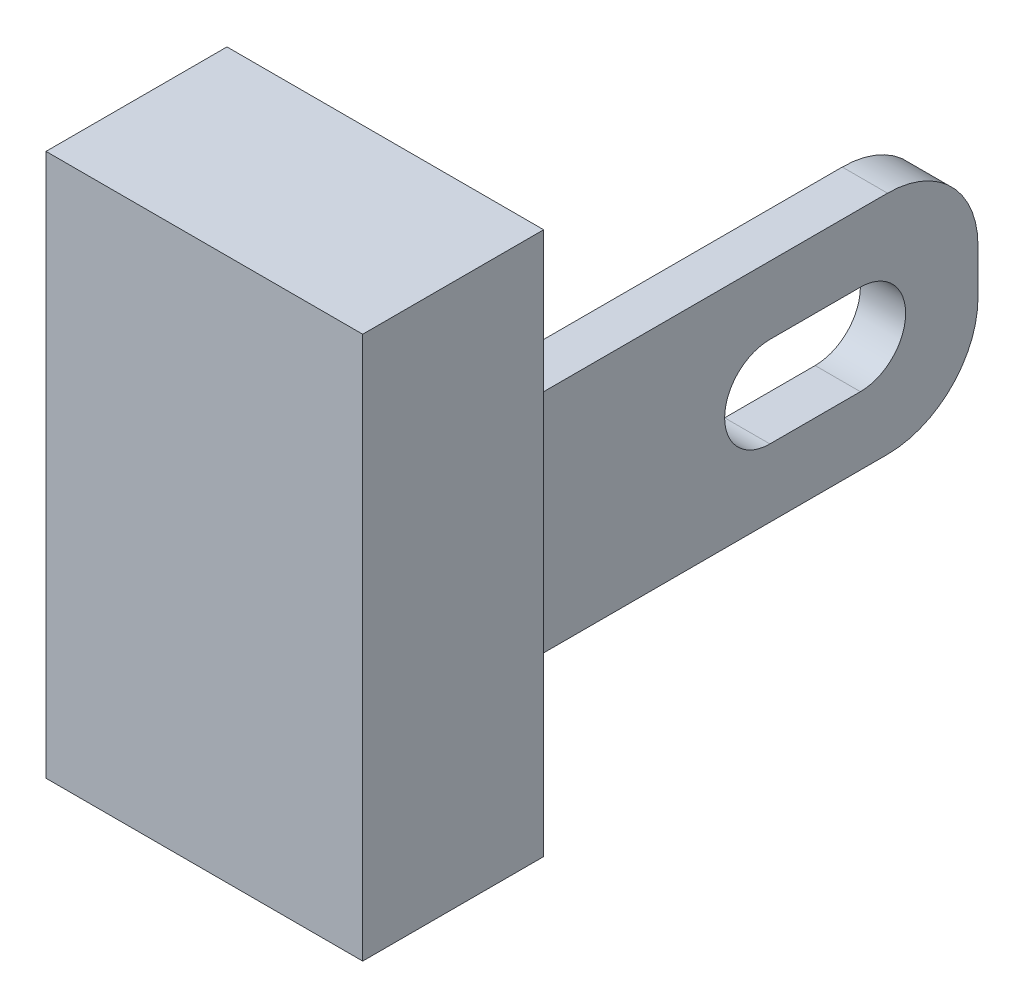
from build123d import *

# Parameters (mm, degrees)
SKETCH1_W           = 3.5
SKETCH1_H           = 6
BOSS_EXTRUDE1_DEPTH = 2
SKETCH2_W           = 0.5
SKETCH2_H           = 2.5
BOSS_EXTRUDE2_DEPTH = 5
FILLET1_R           = 1
CUT_EXTRUDE1_DEPTH  = 5


with BuildPart() as part:
    # Sketch1 → Boss-Extrude1 (new body)
    with BuildSketch(Plane.XY):
        Rectangle(SKETCH1_W, SKETCH1_H)
    extrude(amount=BOSS_EXTRUDE1_DEPTH)

    # Sketch2 → Boss-Extrude2 (add)
    with BuildSketch(Plane(origin=(0, 0, 0), x_dir=(-1, 0, 0), z_dir=(0, 0, -1))):
        with Locations((-1.3, 0)):
            Rectangle(SKETCH2_W, SKETCH2_H)
    extrude(amount=BOSS_EXTRUDE2_DEPTH)

    # Fillet1
    fillet1_edges = [part.edges().sort_by_distance(p)[0] for p in [
        (1.3, 1.25, -5),
        (1.3, -1.25, -5),
    ]]
    fillet(fillet1_edges, radius=FILLET1_R)

    # Sketch3 → Cut-Extrude1 (cut)
    with BuildSketch(Plane(origin=(1.55, 0, 0), x_dir=(0, 0, -1), z_dir=(1, 0, 0))):
        with BuildLine():
            Line((2.7, 0.5), (3.7, 0.5))
            ThreePointArc((3.7, 0.5), (4.2, 0), (3.7, -0.5))
            Line((3.7, -0.5), (2.7, -0.5))
            ThreePointArc((2.7, -0.5), (2.2, 0), (2.7, 0.5))
        make_face()
    extrude(amount=-CUT_EXTRUDE1_DEPTH, mode=Mode.SUBTRACT)


solid = part.part
